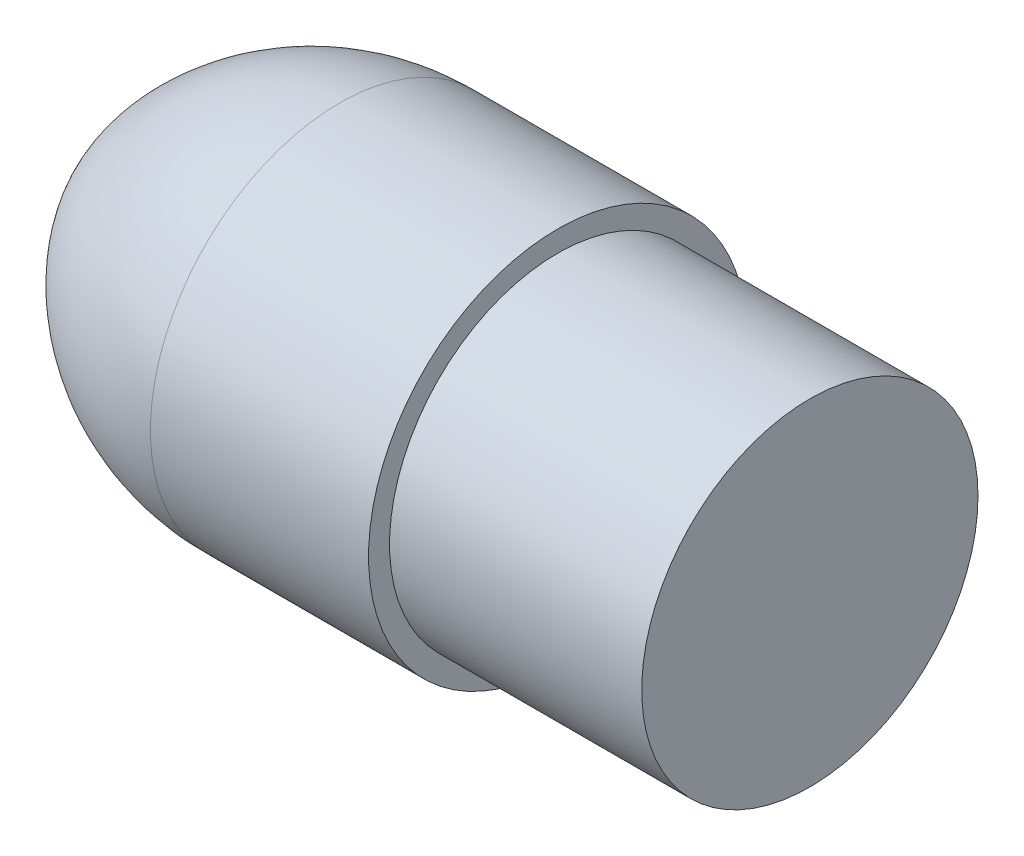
from build123d import *


with BuildPart() as part:
    # Sketch1 → Revolve1 (revolve)
    with BuildSketch(Plane.XY, mode=Mode.PRIVATE) as revolve1_sk:
        with BuildLine():
            Line((0, 0), (0, 2.54))
            Line((0, 2.54), (-3.81, 2.54))
            Line((-3.81, 2.54), (-3.81, 2.8575))
            Line((-3.81, 2.8575), (-7.105983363, 2.8575))
            ThreePointArc((-7.105983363, 2.8575), (-9.439122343, 2.059569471), (-10.795, 0))
            Line((-10.795, 0), (0, 0))
        make_face()
    revolve(revolve1_sk.sketch.rotate(Axis((4.943452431, 0, 0), (-1, 0, 0)), 90), axis=Axis((4.943452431, 0, 0), (-1, 0, 0)))


solid = part.part
